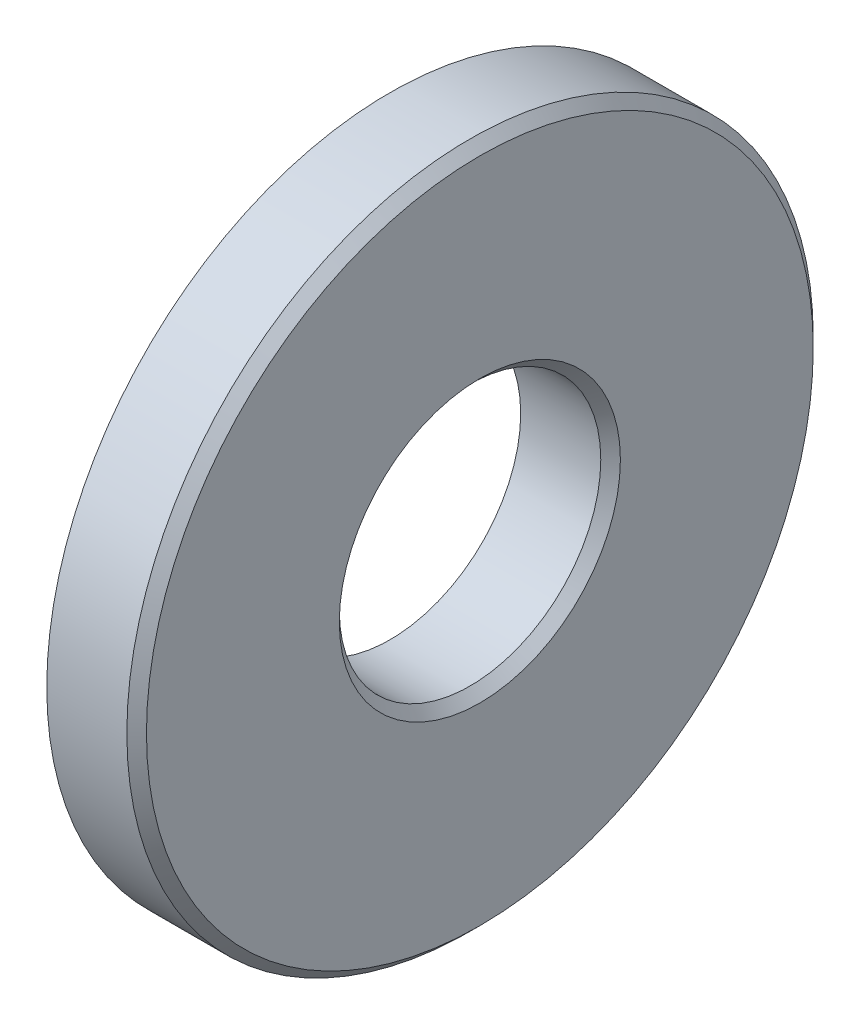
ISO-10303-21;
HEADER;
FILE_DESCRIPTION(('STEP AP214'),'2;1');
FILE_NAME('part.step','',(''),(''),'','','');
FILE_SCHEMA(('AUTOMOTIVE_DESIGN { 1 0 10303 214 1 1 1 1 }'));
ENDSEC;
DATA;
#1=APPLICATION_CONTEXT('core data for automotive mechanical design processes');
#2=APPLICATION_PROTOCOL_DEFINITION('international standard','automotive_design',2000,#1);
#3=PRODUCT_CONTEXT('',#1,'mechanical');
#4=PRODUCT('Part','Part','',(#3));
#5=PRODUCT_RELATED_PRODUCT_CATEGORY('part','',(#4));
#6=PRODUCT_DEFINITION_FORMATION('','',#4);
#7=PRODUCT_DEFINITION_CONTEXT('part definition',#1,'design');
#8=PRODUCT_DEFINITION('design','',#6,#7);
#9=PRODUCT_DEFINITION_SHAPE('','',#8);
#10=(LENGTH_UNIT() NAMED_UNIT(*) SI_UNIT(.MILLI.,.METRE.));
#11=(NAMED_UNIT(*) PLANE_ANGLE_UNIT() SI_UNIT($,.RADIAN.));
#12=(NAMED_UNIT(*) SI_UNIT($,.STERADIAN.) SOLID_ANGLE_UNIT());
#13=UNCERTAINTY_MEASURE_WITH_UNIT(LENGTH_MEASURE(1.E-05),#10,'distance_accuracy_value','');
#14=(GEOMETRIC_REPRESENTATION_CONTEXT(3) GLOBAL_UNCERTAINTY_ASSIGNED_CONTEXT((#13)) GLOBAL_UNIT_ASSIGNED_CONTEXT((#10,
#11,#12)) REPRESENTATION_CONTEXT('',''));
#15=CARTESIAN_POINT('',(0.,0.,0.));
#16=DIRECTION('',(0.,0.,1.));
#17=DIRECTION('',(1.,0.,0.));
#18=AXIS2_PLACEMENT_3D('',#15,#16,#17);
#19=CARTESIAN_POINT('',(0.,0.,0.));
#20=DIRECTION('',(1.,0.,0.));
#21=DIRECTION('',(0.,0.,-1.));
#22=AXIS2_PLACEMENT_3D('',#19,#20,#21);
#23=CYLINDRICAL_SURFACE('',#22,10.5);
#24=CARTESIAN_POINT('',(0.,0.,0.));
#25=DIRECTION('',(1.,0.,0.));
#26=DIRECTION('',(0.,0.,-1.));
#27=AXIS2_PLACEMENT_3D('',#24,#25,#26);
#28=CIRCLE('',#27,10.5);
#29=CARTESIAN_POINT('',(0.,0.,-10.5));
#30=VERTEX_POINT('',#29);
#31=EDGE_CURVE('E10',#30,#30,#28,.T.);
#32=ORIENTED_EDGE('',*,*,#31,.T.);
#33=EDGE_LOOP('',(#32));
#34=FACE_BOUND('',#33,.T.);
#35=CARTESIAN_POINT('',(2.45,0.,0.));
#36=DIRECTION('',(1.,0.,0.));
#37=DIRECTION('',(0.,0.,-1.));
#38=AXIS2_PLACEMENT_3D('',#35,#36,#37);
#39=CIRCLE('',#38,10.5);
#40=CARTESIAN_POINT('',(2.45,0.,-10.5));
#41=VERTEX_POINT('',#40);
#42=EDGE_CURVE('E55',#41,#41,#39,.T.);
#43=ORIENTED_EDGE('',*,*,#42,.F.);
#44=EDGE_LOOP('',(#43));
#45=FACE_BOUND('',#44,.T.);
#46=ADVANCED_FACE('F33',(#34,#45),#23,.T.);
#47=CARTESIAN_POINT('',(0.,10.5,0.));
#48=DIRECTION('',(-1.,0.,0.));
#49=DIRECTION('',(0.,0.,1.));
#50=AXIS2_PLACEMENT_3D('',#47,#48,#49);
#51=PLANE('',#50);
#52=CARTESIAN_POINT('',(0.,0.,0.));
#53=DIRECTION('',(1.,0.,0.));
#54=DIRECTION('',(0.,0.,-1.));
#55=AXIS2_PLACEMENT_3D('',#52,#53,#54);
#56=CIRCLE('',#55,4.);
#57=CARTESIAN_POINT('',(0.,0.,-4.));
#58=VERTEX_POINT('',#57);
#59=EDGE_CURVE('E39',#58,#58,#56,.T.);
#60=ORIENTED_EDGE('',*,*,#59,.T.);
#61=EDGE_LOOP('',(#60));
#62=FACE_BOUND('',#61,.T.);
#63=ORIENTED_EDGE('',*,*,#31,.F.);
#64=EDGE_LOOP('',(#63));
#65=FACE_BOUND('',#64,.T.);
#66=ADVANCED_FACE('F63',(#62,#65),#51,.T.);
#67=CARTESIAN_POINT('',(0.,0.,0.));
#68=DIRECTION('',(1.,0.,0.));
#69=DIRECTION('',(0.,0.,-1.));
#70=AXIS2_PLACEMENT_3D('',#67,#68,#69);
#71=CYLINDRICAL_SURFACE('',#70,4.);
#72=CARTESIAN_POINT('',(2.45,0.,0.));
#73=DIRECTION('',(1.,0.,0.));
#74=DIRECTION('',(0.,0.,-1.));
#75=AXIS2_PLACEMENT_3D('',#72,#73,#74);
#76=CIRCLE('',#75,4.);
#77=CARTESIAN_POINT('',(2.45,0.,-4.));
#78=VERTEX_POINT('',#77);
#79=EDGE_CURVE('E43',#78,#78,#76,.T.);
#80=ORIENTED_EDGE('',*,*,#79,.T.);
#81=EDGE_LOOP('',(#80));
#82=FACE_BOUND('',#81,.T.);
#83=ORIENTED_EDGE('',*,*,#59,.F.);
#84=EDGE_LOOP('',(#83));
#85=FACE_BOUND('',#84,.T.);
#86=ADVANCED_FACE('F67',(#82,#85),#71,.F.);
#87=CARTESIAN_POINT('',(2.45,0.,0.));
#88=DIRECTION('',(1.,0.,0.));
#89=DIRECTION('',(0.,0.,-1.));
#90=AXIS2_PLACEMENT_3D('',#87,#88,#89);
#91=CONICAL_SURFACE('',#90,4.,0.785398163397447);
#92=CARTESIAN_POINT('',(2.75,0.,0.));
#93=DIRECTION('',(1.,0.,0.));
#94=DIRECTION('',(0.,0.,-1.));
#95=AXIS2_PLACEMENT_3D('',#92,#93,#94);
#96=CIRCLE('',#95,4.3);
#97=CARTESIAN_POINT('',(2.75,0.,-4.3));
#98=VERTEX_POINT('',#97);
#99=EDGE_CURVE('E47',#98,#98,#96,.T.);
#100=ORIENTED_EDGE('',*,*,#99,.T.);
#101=EDGE_LOOP('',(#100));
#102=FACE_BOUND('',#101,.T.);
#103=ORIENTED_EDGE('',*,*,#79,.F.);
#104=EDGE_LOOP('',(#103));
#105=FACE_BOUND('',#104,.T.);
#106=ADVANCED_FACE('F71',(#102,#105),#91,.F.);
#107=CARTESIAN_POINT('',(2.75,4.3,0.));
#108=DIRECTION('',(1.,0.,0.));
#109=DIRECTION('',(0.,0.,-1.));
#110=AXIS2_PLACEMENT_3D('',#107,#108,#109);
#111=PLANE('',#110);
#112=CARTESIAN_POINT('',(2.75,0.,0.));
#113=DIRECTION('',(1.,0.,0.));
#114=DIRECTION('',(0.,0.,-1.));
#115=AXIS2_PLACEMENT_3D('',#112,#113,#114);
#116=CIRCLE('',#115,10.2);
#117=CARTESIAN_POINT('',(2.75,0.,-10.2));
#118=VERTEX_POINT('',#117);
#119=EDGE_CURVE('E52',#118,#118,#116,.T.);
#120=ORIENTED_EDGE('',*,*,#119,.T.);
#121=EDGE_LOOP('',(#120));
#122=FACE_BOUND('',#121,.T.);
#123=ORIENTED_EDGE('',*,*,#99,.F.);
#124=EDGE_LOOP('',(#123));
#125=FACE_BOUND('',#124,.T.);
#126=ADVANCED_FACE('F78',(#122,#125),#111,.T.);
#127=CARTESIAN_POINT('',(2.75,0.,0.));
#128=DIRECTION('',(-1.,0.,0.));
#129=DIRECTION('',(0.,0.,1.));
#130=AXIS2_PLACEMENT_3D('',#127,#128,#129);
#131=CONICAL_SURFACE('',#130,10.2,0.785398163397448);
#132=ORIENTED_EDGE('',*,*,#42,.T.);
#133=EDGE_LOOP('',(#132));
#134=FACE_BOUND('',#133,.T.);
#135=ORIENTED_EDGE('',*,*,#119,.F.);
#136=EDGE_LOOP('',(#135));
#137=FACE_BOUND('',#136,.T.);
#138=ADVANCED_FACE('F59',(#134,#137),#131,.T.);
#139=CLOSED_SHELL('',(#46,#66,#86,#106,#126,#138));
#140=MANIFOLD_SOLID_BREP('B2',#139);
#141=ADVANCED_BREP_SHAPE_REPRESENTATION('',(#18,#140),#14);
#142=SHAPE_DEFINITION_REPRESENTATION(#9,#141);
ENDSEC;
END-ISO-10303-21;
